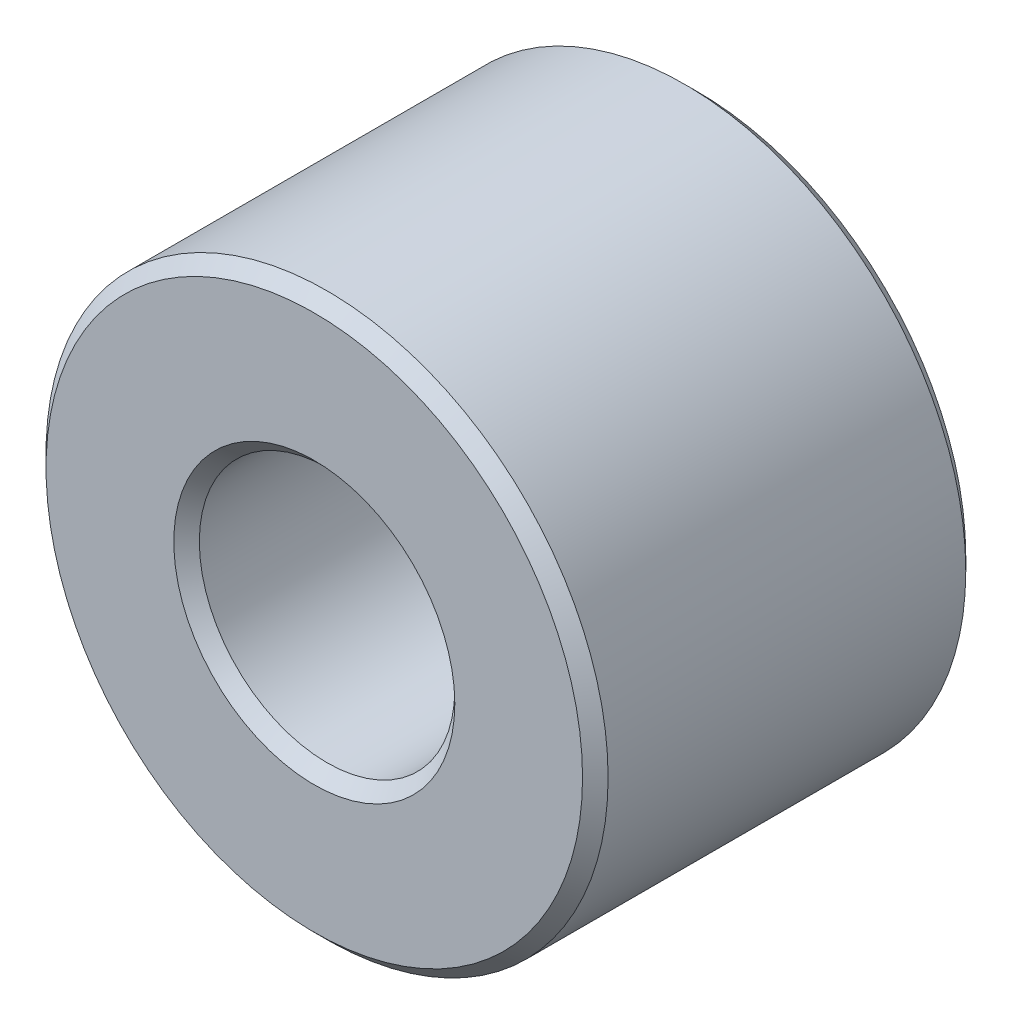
ISO-10303-21;
HEADER;
FILE_DESCRIPTION(('STEP AP214'),'2;1');
FILE_NAME('part.step','',(''),(''),'','','');
FILE_SCHEMA(('AUTOMOTIVE_DESIGN { 1 0 10303 214 1 1 1 1 }'));
ENDSEC;
DATA;
#1=APPLICATION_CONTEXT('core data for automotive mechanical design processes');
#2=APPLICATION_PROTOCOL_DEFINITION('international standard','automotive_design',2000,#1);
#3=PRODUCT_CONTEXT('',#1,'mechanical');
#4=PRODUCT('Part','Part','',(#3));
#5=PRODUCT_RELATED_PRODUCT_CATEGORY('part','',(#4));
#6=PRODUCT_DEFINITION_FORMATION('','',#4);
#7=PRODUCT_DEFINITION_CONTEXT('part definition',#1,'design');
#8=PRODUCT_DEFINITION('design','',#6,#7);
#9=PRODUCT_DEFINITION_SHAPE('','',#8);
#10=(LENGTH_UNIT() NAMED_UNIT(*) SI_UNIT(.MILLI.,.METRE.));
#11=(NAMED_UNIT(*) PLANE_ANGLE_UNIT() SI_UNIT($,.RADIAN.));
#12=(NAMED_UNIT(*) SI_UNIT($,.STERADIAN.) SOLID_ANGLE_UNIT());
#13=UNCERTAINTY_MEASURE_WITH_UNIT(LENGTH_MEASURE(1.E-05),#10,'distance_accuracy_value','');
#14=(GEOMETRIC_REPRESENTATION_CONTEXT(3) GLOBAL_UNCERTAINTY_ASSIGNED_CONTEXT((#13)) GLOBAL_UNIT_ASSIGNED_CONTEXT((#10,
#11,#12)) REPRESENTATION_CONTEXT('',''));
#15=CARTESIAN_POINT('',(0.,0.,0.));
#16=DIRECTION('',(0.,0.,1.));
#17=DIRECTION('',(1.,0.,0.));
#18=AXIS2_PLACEMENT_3D('',#15,#16,#17);
#19=CARTESIAN_POINT('',(0.,0.,7.5));
#20=DIRECTION('',(0.,0.,1.));
#21=DIRECTION('',(1.,0.,0.));
#22=AXIS2_PLACEMENT_3D('',#19,#20,#21);
#23=PLANE('',#22);
#24=CARTESIAN_POINT('',(0.,0.,7.5));
#25=DIRECTION('',(0.,0.,1.));
#26=DIRECTION('',(1.,0.,0.));
#27=AXIS2_PLACEMENT_3D('',#24,#25,#26);
#28=CIRCLE('',#27,5.50000000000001);
#29=CARTESIAN_POINT('',(5.50000000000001,0.,7.5));
#30=VERTEX_POINT('',#29);
#31=EDGE_CURVE('E10',#30,#30,#28,.F.);
#32=ORIENTED_EDGE('',*,*,#31,.T.);
#33=EDGE_LOOP('',(#32));
#34=FACE_BOUND('',#33,.T.);
#35=CARTESIAN_POINT('',(0.,0.,7.5));
#36=DIRECTION('',(0.,0.,1.));
#37=DIRECTION('',(1.,0.,0.));
#38=AXIS2_PLACEMENT_3D('',#35,#36,#37);
#39=CIRCLE('',#38,10.5);
#40=CARTESIAN_POINT('',(10.5,0.,7.5));
#41=VERTEX_POINT('',#40);
#42=EDGE_CURVE('E45',#41,#41,#39,.T.);
#43=ORIENTED_EDGE('',*,*,#42,.T.);
#44=EDGE_LOOP('',(#43));
#45=FACE_BOUND('',#44,.T.);
#46=ADVANCED_FACE('F37',(#34,#45),#23,.T.);
#47=CARTESIAN_POINT('',(0.,0.,-7.5));
#48=DIRECTION('',(0.,0.,1.));
#49=DIRECTION('',(1.,0.,0.));
#50=AXIS2_PLACEMENT_3D('',#47,#48,#49);
#51=PLANE('',#50);
#52=CARTESIAN_POINT('',(0.,0.,-7.5));
#53=DIRECTION('',(0.,0.,1.));
#54=DIRECTION('',(1.,0.,0.));
#55=AXIS2_PLACEMENT_3D('',#52,#53,#54);
#56=CIRCLE('',#55,5.50000000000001);
#57=CARTESIAN_POINT('',(5.50000000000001,0.,-7.5));
#58=VERTEX_POINT('',#57);
#59=EDGE_CURVE('E69',#58,#58,#56,.T.);
#60=ORIENTED_EDGE('',*,*,#59,.T.);
#61=EDGE_LOOP('',(#60));
#62=FACE_BOUND('',#61,.T.);
#63=CARTESIAN_POINT('',(0.,0.,-7.5));
#64=DIRECTION('',(0.,0.,1.));
#65=DIRECTION('',(1.,0.,0.));
#66=AXIS2_PLACEMENT_3D('',#63,#64,#65);
#67=CIRCLE('',#66,10.5);
#68=CARTESIAN_POINT('',(10.5,0.,-7.5));
#69=VERTEX_POINT('',#68);
#70=EDGE_CURVE('E73',#69,#69,#67,.F.);
#71=ORIENTED_EDGE('',*,*,#70,.T.);
#72=EDGE_LOOP('',(#71));
#73=FACE_BOUND('',#72,.T.);
#74=ADVANCED_FACE('F78',(#62,#73),#51,.F.);
#75=CARTESIAN_POINT('',(0.,0.,7.5));
#76=DIRECTION('',(0.,0.,-1.));
#77=DIRECTION('',(-1.,0.,0.));
#78=AXIS2_PLACEMENT_3D('',#75,#76,#77);
#79=CYLINDRICAL_SURFACE('',#78,11.);
#80=CARTESIAN_POINT('',(0.,0.,-7.));
#81=DIRECTION('',(0.,0.,1.));
#82=DIRECTION('',(1.,0.,0.));
#83=AXIS2_PLACEMENT_3D('',#80,#81,#82);
#84=CIRCLE('',#83,11.);
#85=CARTESIAN_POINT('',(11.,0.,-7.));
#86=VERTEX_POINT('',#85);
#87=EDGE_CURVE('E51',#86,#86,#84,.T.);
#88=ORIENTED_EDGE('',*,*,#87,.T.);
#89=EDGE_LOOP('',(#88));
#90=FACE_BOUND('',#89,.T.);
#91=CARTESIAN_POINT('',(0.,0.,7.));
#92=DIRECTION('',(0.,0.,1.));
#93=DIRECTION('',(1.,0.,0.));
#94=AXIS2_PLACEMENT_3D('',#91,#92,#93);
#95=CIRCLE('',#94,11.);
#96=CARTESIAN_POINT('',(11.,0.,7.));
#97=VERTEX_POINT('',#96);
#98=EDGE_CURVE('E57',#97,#97,#95,.F.);
#99=ORIENTED_EDGE('',*,*,#98,.T.);
#100=EDGE_LOOP('',(#99));
#101=FACE_BOUND('',#100,.T.);
#102=ADVANCED_FACE('F88',(#90,#101),#79,.T.);
#103=CARTESIAN_POINT('',(0.,0.,7.5));
#104=DIRECTION('',(0.,0.,-1.));
#105=DIRECTION('',(-1.,0.,0.));
#106=AXIS2_PLACEMENT_3D('',#103,#104,#105);
#107=CYLINDRICAL_SURFACE('',#106,5.);
#108=CARTESIAN_POINT('',(0.,0.,-7.));
#109=DIRECTION('',(0.,0.,1.));
#110=DIRECTION('',(1.,0.,0.));
#111=AXIS2_PLACEMENT_3D('',#108,#109,#110);
#112=CIRCLE('',#111,5.);
#113=CARTESIAN_POINT('',(5.,0.,-7.));
#114=VERTEX_POINT('',#113);
#115=EDGE_CURVE('E62',#114,#114,#112,.F.);
#116=ORIENTED_EDGE('',*,*,#115,.T.);
#117=EDGE_LOOP('',(#116));
#118=FACE_BOUND('',#117,.T.);
#119=CARTESIAN_POINT('',(0.,0.,6.99999999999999));
#120=DIRECTION('',(0.,0.,1.));
#121=DIRECTION('',(1.,0.,0.));
#122=AXIS2_PLACEMENT_3D('',#119,#120,#121);
#123=CIRCLE('',#122,5.);
#124=CARTESIAN_POINT('',(5.,0.,6.99999999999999));
#125=VERTEX_POINT('',#124);
#126=EDGE_CURVE('E65',#125,#125,#123,.T.);
#127=ORIENTED_EDGE('',*,*,#126,.T.);
#128=EDGE_LOOP('',(#127));
#129=FACE_BOUND('',#128,.T.);
#130=ADVANCED_FACE('F91',(#118,#129),#107,.F.);
#131=CARTESIAN_POINT('',(0.,0.,-7.5));
#132=DIRECTION('',(0.,0.,-1.));
#133=DIRECTION('',(-1.,0.,0.));
#134=AXIS2_PLACEMENT_3D('',#131,#132,#133);
#135=CONICAL_SURFACE('',#134,5.50000000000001,0.785398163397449);
#136=ORIENTED_EDGE('',*,*,#115,.F.);
#137=EDGE_LOOP('',(#136));
#138=FACE_BOUND('',#137,.T.);
#139=ORIENTED_EDGE('',*,*,#59,.F.);
#140=EDGE_LOOP('',(#139));
#141=FACE_BOUND('',#140,.T.);
#142=ADVANCED_FACE('F84',(#138,#141),#135,.F.);
#143=CARTESIAN_POINT('',(0.,0.,-7.));
#144=DIRECTION('',(0.,0.,1.));
#145=DIRECTION('',(1.,0.,0.));
#146=AXIS2_PLACEMENT_3D('',#143,#144,#145);
#147=CONICAL_SURFACE('',#146,11.,0.78539816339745);
#148=ORIENTED_EDGE('',*,*,#70,.F.);
#149=EDGE_LOOP('',(#148));
#150=FACE_BOUND('',#149,.T.);
#151=ORIENTED_EDGE('',*,*,#87,.F.);
#152=EDGE_LOOP('',(#151));
#153=FACE_BOUND('',#152,.T.);
#154=ADVANCED_FACE('F80',(#150,#153),#147,.T.);
#155=CARTESIAN_POINT('',(0.,0.,6.99999999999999));
#156=DIRECTION('',(0.,0.,1.));
#157=DIRECTION('',(1.,0.,0.));
#158=AXIS2_PLACEMENT_3D('',#155,#156,#157);
#159=CONICAL_SURFACE('',#158,5.,0.785398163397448);
#160=ORIENTED_EDGE('',*,*,#31,.F.);
#161=EDGE_LOOP('',(#160));
#162=FACE_BOUND('',#161,.T.);
#163=ORIENTED_EDGE('',*,*,#126,.F.);
#164=EDGE_LOOP('',(#163));
#165=FACE_BOUND('',#164,.T.);
#166=ADVANCED_FACE('F83',(#162,#165),#159,.F.);
#167=CARTESIAN_POINT('',(0.,0.,7.5));
#168=DIRECTION('',(0.,0.,-1.));
#169=DIRECTION('',(-1.,0.,0.));
#170=AXIS2_PLACEMENT_3D('',#167,#168,#169);
#171=CONICAL_SURFACE('',#170,10.5,0.785398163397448);
#172=ORIENTED_EDGE('',*,*,#98,.F.);
#173=EDGE_LOOP('',(#172));
#174=FACE_BOUND('',#173,.T.);
#175=ORIENTED_EDGE('',*,*,#42,.F.);
#176=EDGE_LOOP('',(#175));
#177=FACE_BOUND('',#176,.T.);
#178=ADVANCED_FACE('F39',(#174,#177),#171,.T.);
#179=CLOSED_SHELL('',(#46,#74,#102,#130,#142,#154,#166,#178));
#180=MANIFOLD_SOLID_BREP('B2',#179);
#181=ADVANCED_BREP_SHAPE_REPRESENTATION('',(#18,#180),#14);
#182=SHAPE_DEFINITION_REPRESENTATION(#9,#181);
ENDSEC;
END-ISO-10303-21;
